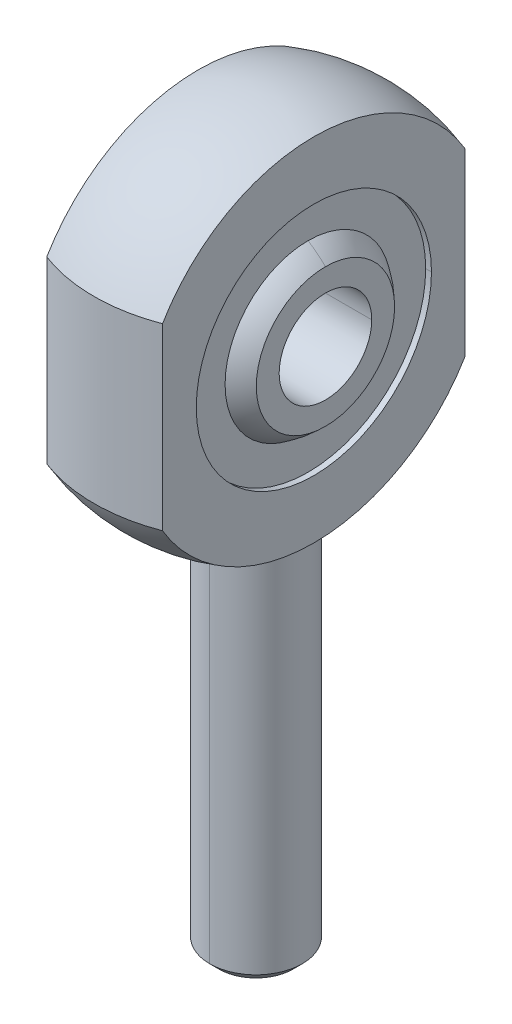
ISO-10303-21;
HEADER;
FILE_DESCRIPTION(('STEP AP214'),'2;1');
FILE_NAME('part.step','',(''),(''),'','','');
FILE_SCHEMA(('AUTOMOTIVE_DESIGN { 1 0 10303 214 1 1 1 1 }'));
ENDSEC;
DATA;
#1=APPLICATION_CONTEXT('core data for automotive mechanical design processes');
#2=APPLICATION_PROTOCOL_DEFINITION('international standard','automotive_design',2000,#1);
#3=PRODUCT_CONTEXT('',#1,'mechanical');
#4=PRODUCT('Part','Part','',(#3));
#5=PRODUCT_RELATED_PRODUCT_CATEGORY('part','',(#4));
#6=PRODUCT_DEFINITION_FORMATION('','',#4);
#7=PRODUCT_DEFINITION_CONTEXT('part definition',#1,'design');
#8=PRODUCT_DEFINITION('design','',#6,#7);
#9=PRODUCT_DEFINITION_SHAPE('','',#8);
#10=(LENGTH_UNIT() NAMED_UNIT(*) SI_UNIT(.MILLI.,.METRE.));
#11=(NAMED_UNIT(*) PLANE_ANGLE_UNIT() SI_UNIT($,.RADIAN.));
#12=(NAMED_UNIT(*) SI_UNIT($,.STERADIAN.) SOLID_ANGLE_UNIT());
#13=UNCERTAINTY_MEASURE_WITH_UNIT(LENGTH_MEASURE(1.E-05),#10,'distance_accuracy_value','');
#14=(GEOMETRIC_REPRESENTATION_CONTEXT(3) GLOBAL_UNCERTAINTY_ASSIGNED_CONTEXT((#13)) GLOBAL_UNIT_ASSIGNED_CONTEXT((#10,
#11,#12)) REPRESENTATION_CONTEXT('',''));
#15=CARTESIAN_POINT('',(0.,0.,0.));
#16=DIRECTION('',(0.,0.,1.));
#17=DIRECTION('',(1.,0.,0.));
#18=AXIS2_PLACEMENT_3D('',#15,#16,#17);
#19=CARTESIAN_POINT('',(4.5,0.,0.));
#20=DIRECTION('',(1.,0.,0.));
#21=DIRECTION('',(0.,1.,0.));
#22=AXIS2_PLACEMENT_3D('',#19,#20,#21);
#23=SPHERICAL_SURFACE('',#22,12.);
#24=CARTESIAN_POINT('',(4.5,-5.80947501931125,0.));
#25=DIRECTION('',(0.,1.,0.));
#26=DIRECTION('',(0.,0.,1.));
#27=AXIS2_PLACEMENT_3D('',#24,#25,#26);
#28=CIRCLE('',#27,10.5);
#29=CARTESIAN_POINT('',(8.25,-5.80947501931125,-9.80752262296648));
#30=VERTEX_POINT('',#29);
#31=CARTESIAN_POINT('',(0.75,-5.80947501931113,-9.80752262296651));
#32=VERTEX_POINT('',#31);
#33=EDGE_CURVE('E11',#30,#32,#28,.T.);
#34=ORIENTED_EDGE('',*,*,#33,.F.);
#35=CARTESIAN_POINT('',(8.25,0.,0.));
#36=DIRECTION('',(1.,0.,0.));
#37=DIRECTION('',(0.,0.,-1.));
#38=AXIS2_PLACEMENT_3D('',#35,#36,#37);
#39=CIRCLE('',#38,11.399013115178);
#40=CARTESIAN_POINT('',(8.25,-5.80947501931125,9.80752262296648));
#41=VERTEX_POINT('',#40);
#42=EDGE_CURVE('E24',#41,#30,#39,.T.);
#43=ORIENTED_EDGE('',*,*,#42,.F.);
#44=CARTESIAN_POINT('',(4.5,-5.80947501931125,0.));
#45=DIRECTION('',(0.,1.,0.));
#46=DIRECTION('',(0.,0.,1.));
#47=AXIS2_PLACEMENT_3D('',#44,#45,#46);
#48=CIRCLE('',#47,10.5);
#49=CARTESIAN_POINT('',(0.75,-5.80947501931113,9.80752262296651));
#50=VERTEX_POINT('',#49);
#51=EDGE_CURVE('E370',#50,#41,#48,.T.);
#52=ORIENTED_EDGE('',*,*,#51,.F.);
#53=CARTESIAN_POINT('',(0.75,0.,0.));
#54=DIRECTION('',(1.,0.,0.));
#55=DIRECTION('',(0.,0.,-1.));
#56=AXIS2_PLACEMENT_3D('',#53,#54,#55);
#57=CIRCLE('',#56,11.399013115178);
#58=EDGE_CURVE('E366',#50,#32,#57,.T.);
#59=ORIENTED_EDGE('',*,*,#58,.T.);
#60=EDGE_LOOP('',(#34,#43,#52,#59));
#61=FACE_BOUND('',#60,.T.);
#62=CARTESIAN_POINT('',(4.5,-11.6189500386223,0.));
#63=DIRECTION('',(0.,1.,0.));
#64=DIRECTION('',(0.,0.,1.));
#65=AXIS2_PLACEMENT_3D('',#62,#63,#64);
#66=CIRCLE('',#65,3.);
#67=CARTESIAN_POINT('',(4.5,-11.6189500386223,3.));
#68=VERTEX_POINT('',#67);
#69=CARTESIAN_POINT('',(4.5,-11.6189500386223,-3.));
#70=VERTEX_POINT('',#69);
#71=EDGE_CURVE('E362',#68,#70,#66,.T.);
#72=ORIENTED_EDGE('',*,*,#71,.T.);
#73=CARTESIAN_POINT('',(4.5,-11.6189500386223,0.));
#74=DIRECTION('',(0.,1.,0.));
#75=DIRECTION('',(0.,0.,1.));
#76=AXIS2_PLACEMENT_3D('',#73,#74,#75);
#77=CIRCLE('',#76,3.);
#78=EDGE_CURVE('E358',#70,#68,#77,.T.);
#79=ORIENTED_EDGE('',*,*,#78,.T.);
#80=EDGE_LOOP('',(#72,#79));
#81=FACE_BOUND('',#80,.T.);
#82=ADVANCED_FACE('F16',(#61,#81),#23,.T.);
#83=CARTESIAN_POINT('',(4.5,-29.255,0.));
#84=DIRECTION('',(0.,-1.,0.));
#85=DIRECTION('',(1.,0.,-1.61702901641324E-09));
#86=AXIS2_PLACEMENT_3D('',#83,#84,#85);
#87=CYLINDRICAL_SURFACE('',#86,3.);
#88=DIRECTION('',(0.,-1.,0.));
#89=VECTOR('',#88,1.);
#90=CARTESIAN_POINT('',(4.5,-11.6189500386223,3.));
#91=LINE('',#90,#89);
#92=CARTESIAN_POINT('',(4.5,-35.3865,3.));
#93=VERTEX_POINT('',#92);
#94=EDGE_CURVE('E353',#68,#93,#91,.T.);
#95=ORIENTED_EDGE('',*,*,#94,.F.);
#96=ORIENTED_EDGE('',*,*,#78,.F.);
#97=DIRECTION('',(0.,-1.,0.));
#98=VECTOR('',#97,1.);
#99=CARTESIAN_POINT('',(4.5,-11.6189500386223,-3.));
#100=LINE('',#99,#98);
#101=CARTESIAN_POINT('',(4.5,-35.3865,-3.));
#102=VERTEX_POINT('',#101);
#103=EDGE_CURVE('E349',#70,#102,#100,.T.);
#104=ORIENTED_EDGE('',*,*,#103,.T.);
#105=CARTESIAN_POINT('',(4.5,-35.3865,0.));
#106=DIRECTION('',(0.,-1.,0.));
#107=DIRECTION('',(0.,0.,-1.));
#108=AXIS2_PLACEMENT_3D('',#105,#106,#107);
#109=CIRCLE('',#108,3.);
#110=EDGE_CURVE('E344',#93,#102,#109,.T.);
#111=ORIENTED_EDGE('',*,*,#110,.F.);
#112=EDGE_LOOP('',(#95,#96,#104,#111));
#113=FACE_BOUND('',#112,.T.);
#114=ADVANCED_FACE('F408',(#113),#87,.T.);
#115=CARTESIAN_POINT('',(4.5,-35.3865,0.));
#116=DIRECTION('',(0.,1.,0.));
#117=DIRECTION('',(1.,0.,0.));
#118=AXIS2_PLACEMENT_3D('',#115,#116,#117);
#119=CONICAL_SURFACE('',#118,3.,0.785398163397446);
#120=DIRECTION('',(0.,0.70710678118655,-0.707106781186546));
#121=VECTOR('',#120,1.);
#122=CARTESIAN_POINT('',(4.5,-36.,-2.3865));
#123=LINE('',#122,#121);
#124=CARTESIAN_POINT('',(4.5,-36.,-2.3865));
#125=VERTEX_POINT('',#124);
#126=EDGE_CURVE('E339',#125,#102,#123,.T.);
#127=ORIENTED_EDGE('',*,*,#126,.F.);
#128=CARTESIAN_POINT('',(4.5,-36.,0.));
#129=DIRECTION('',(0.,-1.,0.));
#130=DIRECTION('',(0.,0.,-1.));
#131=AXIS2_PLACEMENT_3D('',#128,#129,#130);
#132=CIRCLE('',#131,2.3865);
#133=CARTESIAN_POINT('',(4.5,-36.,2.3865));
#134=VERTEX_POINT('',#133);
#135=EDGE_CURVE('E334',#134,#125,#132,.T.);
#136=ORIENTED_EDGE('',*,*,#135,.F.);
#137=DIRECTION('',(0.,0.70710678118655,0.707106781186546));
#138=VECTOR('',#137,1.);
#139=CARTESIAN_POINT('',(4.5,-36.,2.3865));
#140=LINE('',#139,#138);
#141=EDGE_CURVE('E329',#134,#93,#140,.T.);
#142=ORIENTED_EDGE('',*,*,#141,.T.);
#143=ORIENTED_EDGE('',*,*,#110,.T.);
#144=EDGE_LOOP('',(#127,#136,#142,#143));
#145=FACE_BOUND('',#144,.T.);
#146=ADVANCED_FACE('F412',(#145),#119,.T.);
#147=CARTESIAN_POINT('',(4.5,-35.3865,0.));
#148=DIRECTION('',(0.,1.,0.));
#149=DIRECTION('',(-1.,0.,0.));
#150=AXIS2_PLACEMENT_3D('',#147,#148,#149);
#151=CONICAL_SURFACE('',#150,3.,0.785398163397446);
#152=ORIENTED_EDGE('',*,*,#126,.T.);
#153=CARTESIAN_POINT('',(4.5,-35.3865,0.));
#154=DIRECTION('',(0.,-1.,0.));
#155=DIRECTION('',(0.,0.,-1.));
#156=AXIS2_PLACEMENT_3D('',#153,#154,#155);
#157=CIRCLE('',#156,3.);
#158=EDGE_CURVE('E324',#102,#93,#157,.T.);
#159=ORIENTED_EDGE('',*,*,#158,.T.);
#160=ORIENTED_EDGE('',*,*,#141,.F.);
#161=CARTESIAN_POINT('',(4.5,-36.,0.));
#162=DIRECTION('',(0.,-1.,0.));
#163=DIRECTION('',(0.,0.,-1.));
#164=AXIS2_PLACEMENT_3D('',#161,#162,#163);
#165=CIRCLE('',#164,2.3865);
#166=EDGE_CURVE('E319',#125,#134,#165,.T.);
#167=ORIENTED_EDGE('',*,*,#166,.F.);
#168=EDGE_LOOP('',(#152,#159,#160,#167));
#169=FACE_BOUND('',#168,.T.);
#170=ADVANCED_FACE('F417',(#169),#151,.T.);
#171=CARTESIAN_POINT('',(6.8865,-36.,0.));
#172=DIRECTION('',(0.,1.,0.));
#173=DIRECTION('',(0.,0.,1.));
#174=AXIS2_PLACEMENT_3D('',#171,#172,#173);
#175=PLANE('',#174);
#176=ORIENTED_EDGE('',*,*,#166,.T.);
#177=ORIENTED_EDGE('',*,*,#135,.T.);
#178=EDGE_LOOP('',(#176,#177));
#179=FACE_BOUND('',#178,.T.);
#180=ADVANCED_FACE('F424',(#179),#175,.F.);
#181=CARTESIAN_POINT('',(4.5,-29.255,0.));
#182=DIRECTION('',(0.,-1.,0.));
#183=DIRECTION('',(-1.,0.,0.));
#184=AXIS2_PLACEMENT_3D('',#181,#182,#183);
#185=CYLINDRICAL_SURFACE('',#184,3.);
#186=ORIENTED_EDGE('',*,*,#94,.T.);
#187=ORIENTED_EDGE('',*,*,#158,.F.);
#188=ORIENTED_EDGE('',*,*,#103,.F.);
#189=ORIENTED_EDGE('',*,*,#71,.F.);
#190=EDGE_LOOP('',(#186,#187,#188,#189));
#191=FACE_BOUND('',#190,.T.);
#192=ADVANCED_FACE('F404',(#191),#185,.T.);
#193=CARTESIAN_POINT('',(0.75,11.399013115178,0.));
#194=DIRECTION('',(-1.,0.,0.));
#195=DIRECTION('',(0.,0.,1.));
#196=AXIS2_PLACEMENT_3D('',#193,#194,#195);
#197=PLANE('',#196);
#198=CARTESIAN_POINT('',(0.75,0.,0.));
#199=DIRECTION('',(1.,0.,0.));
#200=DIRECTION('',(0.,0.,-1.));
#201=AXIS2_PLACEMENT_3D('',#198,#199,#200);
#202=CIRCLE('',#201,7.62);
#203=CARTESIAN_POINT('',(0.75,0.,-7.62));
#204=VERTEX_POINT('',#203);
#205=CARTESIAN_POINT('',(0.75,0.,7.62));
#206=VERTEX_POINT('',#205);
#207=EDGE_CURVE('E144',#204,#206,#202,.T.);
#208=ORIENTED_EDGE('',*,*,#207,.T.);
#209=CARTESIAN_POINT('',(0.75,0.,0.));
#210=DIRECTION('',(1.,0.,0.));
#211=DIRECTION('',(0.,0.,-1.));
#212=AXIS2_PLACEMENT_3D('',#209,#210,#211);
#213=CIRCLE('',#212,7.62);
#214=EDGE_CURVE('E312',#206,#204,#213,.T.);
#215=ORIENTED_EDGE('',*,*,#214,.T.);
#216=EDGE_LOOP('',(#208,#215));
#217=FACE_BOUND('',#216,.T.);
#218=DIRECTION('',(0.,1.,0.));
#219=VECTOR('',#218,1.);
#220=CARTESIAN_POINT('',(0.75,21.,-9.80752262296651));
#221=LINE('',#220,#219);
#222=CARTESIAN_POINT('',(0.75,5.80947501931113,-9.80752262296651));
#223=VERTEX_POINT('',#222);
#224=EDGE_CURVE('E307',#32,#223,#221,.T.);
#225=ORIENTED_EDGE('',*,*,#224,.F.);
#226=ORIENTED_EDGE('',*,*,#58,.F.);
#227=DIRECTION('',(0.,-1.,0.));
#228=VECTOR('',#227,1.);
#229=CARTESIAN_POINT('',(0.75,21.,9.80752262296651));
#230=LINE('',#229,#228);
#231=CARTESIAN_POINT('',(0.75,5.80947501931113,9.80752262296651));
#232=VERTEX_POINT('',#231);
#233=EDGE_CURVE('E302',#232,#50,#230,.T.);
#234=ORIENTED_EDGE('',*,*,#233,.F.);
#235=CARTESIAN_POINT('',(0.75,0.,0.));
#236=DIRECTION('',(1.,0.,0.));
#237=DIRECTION('',(0.,0.,-1.));
#238=AXIS2_PLACEMENT_3D('',#235,#236,#237);
#239=CIRCLE('',#238,11.399013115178);
#240=EDGE_CURVE('E297',#223,#232,#239,.T.);
#241=ORIENTED_EDGE('',*,*,#240,.F.);
#242=EDGE_LOOP('',(#225,#226,#234,#241));
#243=FACE_BOUND('',#242,.T.);
#244=ADVANCED_FACE('F389',(#217,#243),#197,.T.);
#245=CARTESIAN_POINT('',(4.5,0.,0.));
#246=DIRECTION('',(1.,0.,0.));
#247=DIRECTION('',(0.,-1.,0.));
#248=AXIS2_PLACEMENT_3D('',#245,#246,#247);
#249=SPHERICAL_SURFACE('',#248,12.);
#250=CARTESIAN_POINT('',(4.5,5.80947501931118,0.));
#251=DIRECTION('',(0.,-1.,0.));
#252=DIRECTION('',(0.,0.,-1.));
#253=AXIS2_PLACEMENT_3D('',#250,#251,#252);
#254=CIRCLE('',#253,10.5);
#255=CARTESIAN_POINT('',(8.25,5.80947501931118,-9.8075226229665));
#256=VERTEX_POINT('',#255);
#257=EDGE_CURVE('E292',#223,#256,#254,.T.);
#258=ORIENTED_EDGE('',*,*,#257,.F.);
#259=ORIENTED_EDGE('',*,*,#240,.T.);
#260=CARTESIAN_POINT('',(4.5,5.80947501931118,0.));
#261=DIRECTION('',(0.,-1.,0.));
#262=DIRECTION('',(0.,0.,-1.));
#263=AXIS2_PLACEMENT_3D('',#260,#261,#262);
#264=CIRCLE('',#263,10.5);
#265=CARTESIAN_POINT('',(8.25,5.80947501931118,9.8075226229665));
#266=VERTEX_POINT('',#265);
#267=EDGE_CURVE('E287',#266,#232,#264,.T.);
#268=ORIENTED_EDGE('',*,*,#267,.F.);
#269=CARTESIAN_POINT('',(8.25,0.,0.));
#270=DIRECTION('',(1.,0.,0.));
#271=DIRECTION('',(0.,0.,-1.));
#272=AXIS2_PLACEMENT_3D('',#269,#270,#271);
#273=CIRCLE('',#272,11.399013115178);
#274=EDGE_CURVE('E282',#256,#266,#273,.T.);
#275=ORIENTED_EDGE('',*,*,#274,.F.);
#276=EDGE_LOOP('',(#258,#259,#268,#275));
#277=FACE_BOUND('',#276,.T.);
#278=ADVANCED_FACE('F394',(#277),#249,.T.);
#279=CARTESIAN_POINT('',(8.25,7.62,0.));
#280=DIRECTION('',(1.,0.,0.));
#281=DIRECTION('',(0.,0.,-1.));
#282=AXIS2_PLACEMENT_3D('',#279,#280,#281);
#283=PLANE('',#282);
#284=DIRECTION('',(0.,-1.,0.));
#285=VECTOR('',#284,1.);
#286=CARTESIAN_POINT('',(8.25,21.,-9.80752262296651));
#287=LINE('',#286,#285);
#288=EDGE_CURVE('E278',#256,#30,#287,.T.);
#289=ORIENTED_EDGE('',*,*,#288,.F.);
#290=ORIENTED_EDGE('',*,*,#274,.T.);
#291=DIRECTION('',(0.,1.,0.));
#292=VECTOR('',#291,1.);
#293=CARTESIAN_POINT('',(8.25,21.,9.80752262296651));
#294=LINE('',#293,#292);
#295=EDGE_CURVE('E273',#41,#266,#294,.T.);
#296=ORIENTED_EDGE('',*,*,#295,.F.);
#297=ORIENTED_EDGE('',*,*,#42,.T.);
#298=EDGE_LOOP('',(#289,#290,#296,#297));
#299=FACE_BOUND('',#298,.T.);
#300=CARTESIAN_POINT('',(8.25,0.,0.));
#301=DIRECTION('',(1.,0.,0.));
#302=DIRECTION('',(0.,0.,-1.));
#303=AXIS2_PLACEMENT_3D('',#300,#301,#302);
#304=CIRCLE('',#303,7.62);
#305=CARTESIAN_POINT('',(8.25,0.,7.62));
#306=VERTEX_POINT('',#305);
#307=CARTESIAN_POINT('',(8.25,0.,-7.62));
#308=VERTEX_POINT('',#307);
#309=EDGE_CURVE('E268',#306,#308,#304,.T.);
#310=ORIENTED_EDGE('',*,*,#309,.F.);
#311=CARTESIAN_POINT('',(8.25,0.,0.));
#312=DIRECTION('',(1.,0.,0.));
#313=DIRECTION('',(0.,0.,-1.));
#314=AXIS2_PLACEMENT_3D('',#311,#312,#313);
#315=CIRCLE('',#314,7.62);
#316=EDGE_CURVE('E263',#308,#306,#315,.T.);
#317=ORIENTED_EDGE('',*,*,#316,.F.);
#318=EDGE_LOOP('',(#310,#317));
#319=FACE_BOUND('',#318,.T.);
#320=ADVANCED_FACE('F381',(#299,#319),#283,.T.);
#321=CARTESIAN_POINT('',(100.,0.,0.));
#322=DIRECTION('',(1.,0.,0.));
#323=DIRECTION('',(0.,-1.,0.));
#324=AXIS2_PLACEMENT_3D('',#321,#322,#323);
#325=CYLINDRICAL_SURFACE('',#324,7.62);
#326=DIRECTION('',(1.,0.,0.));
#327=VECTOR('',#326,1.);
#328=CARTESIAN_POINT('',(7.875,0.,7.62));
#329=LINE('',#328,#327);
#330=CARTESIAN_POINT('',(7.875,0.,7.62));
#331=VERTEX_POINT('',#330);
#332=EDGE_CURVE('E258',#331,#306,#329,.T.);
#333=ORIENTED_EDGE('',*,*,#332,.F.);
#334=CARTESIAN_POINT('',(7.875,0.,0.));
#335=DIRECTION('',(1.,0.,0.));
#336=DIRECTION('',(0.,0.,-1.));
#337=AXIS2_PLACEMENT_3D('',#334,#335,#336);
#338=CIRCLE('',#337,7.62);
#339=CARTESIAN_POINT('',(7.875,0.,-7.62));
#340=VERTEX_POINT('',#339);
#341=EDGE_CURVE('E253',#340,#331,#338,.T.);
#342=ORIENTED_EDGE('',*,*,#341,.F.);
#343=DIRECTION('',(1.,0.,0.));
#344=VECTOR('',#343,1.);
#345=CARTESIAN_POINT('',(7.875,0.,-7.62));
#346=LINE('',#345,#344);
#347=EDGE_CURVE('E248',#340,#308,#346,.T.);
#348=ORIENTED_EDGE('',*,*,#347,.T.);
#349=ORIENTED_EDGE('',*,*,#316,.T.);
#350=EDGE_LOOP('',(#333,#342,#348,#349));
#351=FACE_BOUND('',#350,.T.);
#352=ADVANCED_FACE('F402',(#351),#325,.F.);
#353=CARTESIAN_POINT('',(100.,0.,0.));
#354=DIRECTION('',(1.,0.,0.));
#355=DIRECTION('',(0.,1.,0.));
#356=AXIS2_PLACEMENT_3D('',#353,#354,#355);
#357=CYLINDRICAL_SURFACE('',#356,7.62);
#358=ORIENTED_EDGE('',*,*,#332,.T.);
#359=ORIENTED_EDGE('',*,*,#309,.T.);
#360=ORIENTED_EDGE('',*,*,#347,.F.);
#361=CARTESIAN_POINT('',(7.875,0.,0.));
#362=DIRECTION('',(1.,0.,0.));
#363=DIRECTION('',(0.,0.,-1.));
#364=AXIS2_PLACEMENT_3D('',#361,#362,#363);
#365=CIRCLE('',#364,7.62);
#366=EDGE_CURVE('E243',#331,#340,#365,.T.);
#367=ORIENTED_EDGE('',*,*,#366,.F.);
#368=EDGE_LOOP('',(#358,#359,#360,#367));
#369=FACE_BOUND('',#368,.T.);
#370=ADVANCED_FACE('F469',(#369),#357,.F.);
#371=CARTESIAN_POINT('',(7.875,5.3788358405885,0.));
#372=DIRECTION('',(1.,0.,0.));
#373=DIRECTION('',(0.,0.,-1.));
#374=AXIS2_PLACEMENT_3D('',#371,#372,#373);
#375=PLANE('',#374);
#376=ORIENTED_EDGE('',*,*,#341,.T.);
#377=ORIENTED_EDGE('',*,*,#366,.T.);
#378=EDGE_LOOP('',(#376,#377));
#379=FACE_BOUND('',#378,.T.);
#380=CARTESIAN_POINT('',(7.875,0.,0.));
#381=DIRECTION('',(1.,0.,0.));
#382=DIRECTION('',(0.,-1.,0.));
#383=AXIS2_PLACEMENT_3D('',#380,#381,#382);
#384=CIRCLE('',#383,5.3788358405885);
#385=CARTESIAN_POINT('',(7.87500000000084,-5.3788358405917,0.));
#386=VERTEX_POINT('',#385);
#387=CARTESIAN_POINT('',(7.87500000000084,5.37883584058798,0.));
#388=VERTEX_POINT('',#387);
#389=EDGE_CURVE('E238',#386,#388,#384,.T.);
#390=ORIENTED_EDGE('',*,*,#389,.F.);
#391=CARTESIAN_POINT('',(7.875,0.,0.));
#392=DIRECTION('',(1.,0.,0.));
#393=DIRECTION('',(0.,0.,-1.));
#394=AXIS2_PLACEMENT_3D('',#391,#392,#393);
#395=CIRCLE('',#394,5.3788358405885);
#396=EDGE_CURVE('E233',#388,#386,#395,.T.);
#397=ORIENTED_EDGE('',*,*,#396,.F.);
#398=EDGE_LOOP('',(#390,#397));
#399=FACE_BOUND('',#398,.T.);
#400=ADVANCED_FACE('F479',(#379,#399),#375,.T.);
#401=CARTESIAN_POINT('',(4.49999999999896,-1.86135828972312E-12,0.));
#402=DIRECTION('',(1.,0.,0.));
#403=DIRECTION('',(0.,0.,-1.));
#404=AXIS2_PLACEMENT_3D('',#401,#402,#403);
#405=SPHERICAL_SURFACE('',#404,6.35000000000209);
#406=CARTESIAN_POINT('',(4.49999999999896,-1.86135828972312E-12,0.));
#407=DIRECTION('',(0.,0.,-1.));
#408=DIRECTION('',(0.708661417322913,-0.705548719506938,0.));
#409=AXIS2_PLACEMENT_3D('',#406,#407,#408);
#410=CIRCLE('',#409,6.35000000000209);
#411=CARTESIAN_POINT('',(9.00000000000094,-4.48023436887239,0.));
#412=VERTEX_POINT('',#411);
#413=EDGE_CURVE('E228',#412,#386,#410,.T.);
#414=ORIENTED_EDGE('',*,*,#413,.F.);
#415=CARTESIAN_POINT('',(9.,0.,0.));
#416=DIRECTION('',(1.,0.,0.));
#417=DIRECTION('',(0.,0.,-1.));
#418=AXIS2_PLACEMENT_3D('',#415,#416,#417);
#419=CIRCLE('',#418,4.4802343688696);
#420=CARTESIAN_POINT('',(9.00000000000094,4.48023436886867,0.));
#421=VERTEX_POINT('',#420);
#422=EDGE_CURVE('E223',#421,#412,#419,.T.);
#423=ORIENTED_EDGE('',*,*,#422,.F.);
#424=CARTESIAN_POINT('',(4.49999999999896,-1.86135828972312E-12,0.));
#425=DIRECTION('',(0.,0.,1.));
#426=DIRECTION('',(0.708661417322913,0.705548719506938,0.));
#427=AXIS2_PLACEMENT_3D('',#424,#425,#426);
#428=CIRCLE('',#427,6.35000000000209);
#429=EDGE_CURVE('E218',#421,#388,#428,.T.);
#430=ORIENTED_EDGE('',*,*,#429,.T.);
#431=ORIENTED_EDGE('',*,*,#396,.T.);
#432=EDGE_LOOP('',(#414,#423,#430,#431));
#433=FACE_BOUND('',#432,.T.);
#434=ADVANCED_FACE('F489',(#433),#405,.T.);
#435=CARTESIAN_POINT('',(4.49999999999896,-1.86135828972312E-12,0.));
#436=DIRECTION('',(1.,0.,0.));
#437=DIRECTION('',(0.,0.,1.));
#438=AXIS2_PLACEMENT_3D('',#435,#436,#437);
#439=SPHERICAL_SURFACE('',#438,6.35000000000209);
#440=ORIENTED_EDGE('',*,*,#413,.T.);
#441=ORIENTED_EDGE('',*,*,#389,.T.);
#442=ORIENTED_EDGE('',*,*,#429,.F.);
#443=CARTESIAN_POINT('',(9.,0.,0.));
#444=DIRECTION('',(1.,0.,0.));
#445=DIRECTION('',(0.,-1.,0.));
#446=AXIS2_PLACEMENT_3D('',#443,#444,#445);
#447=CIRCLE('',#446,4.4802343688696);
#448=EDGE_CURVE('E213',#412,#421,#447,.T.);
#449=ORIENTED_EDGE('',*,*,#448,.F.);
#450=EDGE_LOOP('',(#440,#441,#442,#449));
#451=FACE_BOUND('',#450,.T.);
#452=ADVANCED_FACE('F499',(#451),#439,.T.);
#453=CARTESIAN_POINT('',(9.,3.,0.));
#454=DIRECTION('',(1.,0.,0.));
#455=DIRECTION('',(0.,0.,-1.));
#456=AXIS2_PLACEMENT_3D('',#453,#454,#455);
#457=PLANE('',#456);
#458=ORIENTED_EDGE('',*,*,#422,.T.);
#459=ORIENTED_EDGE('',*,*,#448,.T.);
#460=EDGE_LOOP('',(#458,#459));
#461=FACE_BOUND('',#460,.T.);
#462=CARTESIAN_POINT('',(9.,0.,0.));
#463=DIRECTION('',(1.,0.,0.));
#464=DIRECTION('',(0.,0.,-1.));
#465=AXIS2_PLACEMENT_3D('',#462,#463,#464);
#466=CIRCLE('',#465,3.);
#467=CARTESIAN_POINT('',(9.,0.,3.));
#468=VERTEX_POINT('',#467);
#469=CARTESIAN_POINT('',(9.,0.,-3.));
#470=VERTEX_POINT('',#469);
#471=EDGE_CURVE('E208',#468,#470,#466,.T.);
#472=ORIENTED_EDGE('',*,*,#471,.F.);
#473=CARTESIAN_POINT('',(9.,0.,0.));
#474=DIRECTION('',(1.,0.,0.));
#475=DIRECTION('',(0.,0.,-1.));
#476=AXIS2_PLACEMENT_3D('',#473,#474,#475);
#477=CIRCLE('',#476,3.);
#478=EDGE_CURVE('E203',#470,#468,#477,.T.);
#479=ORIENTED_EDGE('',*,*,#478,.F.);
#480=EDGE_LOOP('',(#472,#479));
#481=FACE_BOUND('',#480,.T.);
#482=ADVANCED_FACE('F509',(#461,#481),#457,.T.);
#483=CARTESIAN_POINT('',(100.,0.,0.));
#484=DIRECTION('',(1.,0.,0.));
#485=DIRECTION('',(0.,-1.,0.));
#486=AXIS2_PLACEMENT_3D('',#483,#484,#485);
#487=CYLINDRICAL_SURFACE('',#486,3.);
#488=DIRECTION('',(1.,0.,0.));
#489=VECTOR('',#488,1.);
#490=CARTESIAN_POINT('',(0.,0.,3.));
#491=LINE('',#490,#489);
#492=CARTESIAN_POINT('',(0.,0.,3.));
#493=VERTEX_POINT('',#492);
#494=EDGE_CURVE('E198',#493,#468,#491,.T.);
#495=ORIENTED_EDGE('',*,*,#494,.F.);
#496=CARTESIAN_POINT('',(0.,0.,0.));
#497=DIRECTION('',(1.,0.,0.));
#498=DIRECTION('',(0.,0.,-1.));
#499=AXIS2_PLACEMENT_3D('',#496,#497,#498);
#500=CIRCLE('',#499,3.);
#501=CARTESIAN_POINT('',(0.,0.,-3.));
#502=VERTEX_POINT('',#501);
#503=EDGE_CURVE('E193',#502,#493,#500,.T.);
#504=ORIENTED_EDGE('',*,*,#503,.F.);
#505=DIRECTION('',(1.,0.,0.));
#506=VECTOR('',#505,1.);
#507=CARTESIAN_POINT('',(0.,0.,-3.));
#508=LINE('',#507,#506);
#509=EDGE_CURVE('E188',#502,#470,#508,.T.);
#510=ORIENTED_EDGE('',*,*,#509,.T.);
#511=ORIENTED_EDGE('',*,*,#478,.T.);
#512=EDGE_LOOP('',(#495,#504,#510,#511));
#513=FACE_BOUND('',#512,.T.);
#514=ADVANCED_FACE('F519',(#513),#487,.F.);
#515=CARTESIAN_POINT('',(100.,0.,0.));
#516=DIRECTION('',(1.,0.,0.));
#517=DIRECTION('',(0.,1.,0.));
#518=AXIS2_PLACEMENT_3D('',#515,#516,#517);
#519=CYLINDRICAL_SURFACE('',#518,3.);
#520=ORIENTED_EDGE('',*,*,#494,.T.);
#521=ORIENTED_EDGE('',*,*,#471,.T.);
#522=ORIENTED_EDGE('',*,*,#509,.F.);
#523=CARTESIAN_POINT('',(0.,0.,0.));
#524=DIRECTION('',(1.,0.,0.));
#525=DIRECTION('',(0.,0.,-1.));
#526=AXIS2_PLACEMENT_3D('',#523,#524,#525);
#527=CIRCLE('',#526,3.);
#528=EDGE_CURVE('E183',#493,#502,#527,.T.);
#529=ORIENTED_EDGE('',*,*,#528,.F.);
#530=EDGE_LOOP('',(#520,#521,#522,#529));
#531=FACE_BOUND('',#530,.T.);
#532=ADVANCED_FACE('F529',(#531),#519,.F.);
#533=CARTESIAN_POINT('',(0.,4.4802343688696,0.));
#534=DIRECTION('',(-1.,0.,0.));
#535=DIRECTION('',(0.,0.,1.));
#536=AXIS2_PLACEMENT_3D('',#533,#534,#535);
#537=PLANE('',#536);
#538=ORIENTED_EDGE('',*,*,#503,.T.);
#539=ORIENTED_EDGE('',*,*,#528,.T.);
#540=EDGE_LOOP('',(#538,#539));
#541=FACE_BOUND('',#540,.T.);
#542=CARTESIAN_POINT('',(0.,0.,0.));
#543=DIRECTION('',(1.,0.,0.));
#544=DIRECTION('',(0.,0.,-1.));
#545=AXIS2_PLACEMENT_3D('',#542,#543,#544);
#546=CIRCLE('',#545,4.4802343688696);
#547=CARTESIAN_POINT('',(-2.61302091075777E-12,4.48023436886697,0.));
#548=VERTEX_POINT('',#547);
#549=CARTESIAN_POINT('',(-2.61302091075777E-12,-4.48023436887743,0.));
#550=VERTEX_POINT('',#549);
#551=EDGE_CURVE('E178',#548,#550,#546,.T.);
#552=ORIENTED_EDGE('',*,*,#551,.F.);
#553=CARTESIAN_POINT('',(0.,0.,0.));
#554=DIRECTION('',(1.,0.,0.));
#555=DIRECTION('',(0.,-1.,0.));
#556=AXIS2_PLACEMENT_3D('',#553,#554,#555);
#557=CIRCLE('',#556,4.4802343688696);
#558=EDGE_CURVE('E173',#550,#548,#557,.T.);
#559=ORIENTED_EDGE('',*,*,#558,.F.);
#560=EDGE_LOOP('',(#552,#559));
#561=FACE_BOUND('',#560,.T.);
#562=ADVANCED_FACE('F539',(#541,#561),#537,.T.);
#563=CARTESIAN_POINT('',(4.50000000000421,-5.22758919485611E-12,0.));
#564=DIRECTION('',(1.,0.,0.));
#565=DIRECTION('',(0.,0.,1.));
#566=AXIS2_PLACEMENT_3D('',#563,#564,#565);
#567=SPHERICAL_SURFACE('',#566,6.3500000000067);
#568=CARTESIAN_POINT('',(4.50000000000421,-5.22758919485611E-12,0.));
#569=DIRECTION('',(0.,0.,-1.));
#570=DIRECTION('',(-0.531496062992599,-0.847060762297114,0.));
#571=AXIS2_PLACEMENT_3D('',#568,#569,#570);
#572=CIRCLE('',#571,6.3500000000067);
#573=CARTESIAN_POINT('',(1.12499999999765,-5.37883584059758,0.));
#574=VERTEX_POINT('',#573);
#575=EDGE_CURVE('E168',#574,#550,#572,.T.);
#576=ORIENTED_EDGE('',*,*,#575,.T.);
#577=ORIENTED_EDGE('',*,*,#558,.T.);
#578=CARTESIAN_POINT('',(4.50000000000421,-5.22758919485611E-12,0.));
#579=DIRECTION('',(0.,0.,1.));
#580=DIRECTION('',(-0.531496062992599,0.847060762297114,0.));
#581=AXIS2_PLACEMENT_3D('',#578,#579,#580);
#582=CIRCLE('',#581,6.3500000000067);
#583=CARTESIAN_POINT('',(1.12499999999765,5.37883584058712,0.));
#584=VERTEX_POINT('',#583);
#585=EDGE_CURVE('E163',#584,#548,#582,.T.);
#586=ORIENTED_EDGE('',*,*,#585,.F.);
#587=CARTESIAN_POINT('',(1.125,0.,0.));
#588=DIRECTION('',(1.,0.,0.));
#589=DIRECTION('',(0.,-1.,0.));
#590=AXIS2_PLACEMENT_3D('',#587,#588,#589);
#591=CIRCLE('',#590,5.3788358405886);
#592=EDGE_CURVE('E152',#574,#584,#591,.T.);
#593=ORIENTED_EDGE('',*,*,#592,.F.);
#594=EDGE_LOOP('',(#576,#577,#586,#593));
#595=FACE_BOUND('',#594,.T.);
#596=ADVANCED_FACE('F549',(#595),#567,.T.);
#597=CARTESIAN_POINT('',(1.125,7.62,0.));
#598=DIRECTION('',(-1.,0.,0.));
#599=DIRECTION('',(0.,0.,1.));
#600=AXIS2_PLACEMENT_3D('',#597,#598,#599);
#601=PLANE('',#600);
#602=CARTESIAN_POINT('',(1.125,0.,0.));
#603=DIRECTION('',(1.,0.,0.));
#604=DIRECTION('',(0.,0.,-1.));
#605=AXIS2_PLACEMENT_3D('',#602,#603,#604);
#606=CIRCLE('',#605,5.3788358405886);
#607=EDGE_CURVE('E149',#584,#574,#606,.T.);
#608=ORIENTED_EDGE('',*,*,#607,.T.);
#609=ORIENTED_EDGE('',*,*,#592,.T.);
#610=EDGE_LOOP('',(#608,#609));
#611=FACE_BOUND('',#610,.T.);
#612=CARTESIAN_POINT('',(1.125,0.,0.));
#613=DIRECTION('',(1.,0.,0.));
#614=DIRECTION('',(0.,0.,-1.));
#615=AXIS2_PLACEMENT_3D('',#612,#613,#614);
#616=CIRCLE('',#615,7.62);
#617=CARTESIAN_POINT('',(1.125,0.,7.62));
#618=VERTEX_POINT('',#617);
#619=CARTESIAN_POINT('',(1.125,0.,-7.62));
#620=VERTEX_POINT('',#619);
#621=EDGE_CURVE('E134',#618,#620,#616,.T.);
#622=ORIENTED_EDGE('',*,*,#621,.F.);
#623=CARTESIAN_POINT('',(1.125,0.,0.));
#624=DIRECTION('',(1.,0.,0.));
#625=DIRECTION('',(0.,0.,-1.));
#626=AXIS2_PLACEMENT_3D('',#623,#624,#625);
#627=CIRCLE('',#626,7.62);
#628=EDGE_CURVE('E130',#620,#618,#627,.T.);
#629=ORIENTED_EDGE('',*,*,#628,.F.);
#630=EDGE_LOOP('',(#622,#629));
#631=FACE_BOUND('',#630,.T.);
#632=ADVANCED_FACE('F132',(#611,#631),#601,.T.);
#633=CARTESIAN_POINT('',(100.,0.,0.));
#634=DIRECTION('',(1.,0.,0.));
#635=DIRECTION('',(0.,-1.,0.));
#636=AXIS2_PLACEMENT_3D('',#633,#634,#635);
#637=CYLINDRICAL_SURFACE('',#636,7.62);
#638=DIRECTION('',(1.,0.,0.));
#639=VECTOR('',#638,1.);
#640=CARTESIAN_POINT('',(0.75,0.,7.62));
#641=LINE('',#640,#639);
#642=EDGE_CURVE('E138',#206,#618,#641,.T.);
#643=ORIENTED_EDGE('',*,*,#642,.F.);
#644=ORIENTED_EDGE('',*,*,#207,.F.);
#645=DIRECTION('',(1.,0.,0.));
#646=VECTOR('',#645,1.);
#647=CARTESIAN_POINT('',(0.75,0.,-7.62));
#648=LINE('',#647,#646);
#649=EDGE_CURVE('E142',#204,#620,#648,.T.);
#650=ORIENTED_EDGE('',*,*,#649,.T.);
#651=ORIENTED_EDGE('',*,*,#628,.T.);
#652=EDGE_LOOP('',(#643,#644,#650,#651));
#653=FACE_BOUND('',#652,.T.);
#654=ADVANCED_FACE('F143',(#653),#637,.F.);
#655=CARTESIAN_POINT('',(100.,0.,0.));
#656=DIRECTION('',(1.,0.,0.));
#657=DIRECTION('',(0.,1.,0.));
#658=AXIS2_PLACEMENT_3D('',#655,#656,#657);
#659=CYLINDRICAL_SURFACE('',#658,7.62);
#660=ORIENTED_EDGE('',*,*,#642,.T.);
#661=ORIENTED_EDGE('',*,*,#621,.T.);
#662=ORIENTED_EDGE('',*,*,#649,.F.);
#663=ORIENTED_EDGE('',*,*,#214,.F.);
#664=EDGE_LOOP('',(#660,#661,#662,#663));
#665=FACE_BOUND('',#664,.T.);
#666=ADVANCED_FACE('F148',(#665),#659,.F.);
#667=CARTESIAN_POINT('',(4.50000000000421,-5.22758919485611E-12,0.));
#668=DIRECTION('',(1.,0.,0.));
#669=DIRECTION('',(0.,0.,-1.));
#670=AXIS2_PLACEMENT_3D('',#667,#668,#669);
#671=SPHERICAL_SURFACE('',#670,6.3500000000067);
#672=ORIENTED_EDGE('',*,*,#575,.F.);
#673=ORIENTED_EDGE('',*,*,#607,.F.);
#674=ORIENTED_EDGE('',*,*,#585,.T.);
#675=ORIENTED_EDGE('',*,*,#551,.T.);
#676=EDGE_LOOP('',(#672,#673,#674,#675));
#677=FACE_BOUND('',#676,.T.);
#678=ADVANCED_FACE('F585',(#677),#671,.T.);
#679=CARTESIAN_POINT('',(4.5,21.,0.));
#680=DIRECTION('',(0.,-1.,0.));
#681=DIRECTION('',(0.,0.,-1.));
#682=AXIS2_PLACEMENT_3D('',#679,#680,#681);
#683=CYLINDRICAL_SURFACE('',#682,10.5);
#684=ORIENTED_EDGE('',*,*,#295,.T.);
#685=ORIENTED_EDGE('',*,*,#267,.T.);
#686=ORIENTED_EDGE('',*,*,#233,.T.);
#687=ORIENTED_EDGE('',*,*,#51,.T.);
#688=EDGE_LOOP('',(#684,#685,#686,#687));
#689=FACE_BOUND('',#688,.T.);
#690=ADVANCED_FACE('F384',(#689),#683,.T.);
#691=CARTESIAN_POINT('',(4.5,21.,0.));
#692=DIRECTION('',(0.,-1.,0.));
#693=DIRECTION('',(0.,0.,1.));
#694=AXIS2_PLACEMENT_3D('',#691,#692,#693);
#695=CYLINDRICAL_SURFACE('',#694,10.5);
#696=ORIENTED_EDGE('',*,*,#288,.T.);
#697=ORIENTED_EDGE('',*,*,#33,.T.);
#698=ORIENTED_EDGE('',*,*,#224,.T.);
#699=ORIENTED_EDGE('',*,*,#257,.T.);
#700=EDGE_LOOP('',(#696,#697,#698,#699));
#701=FACE_BOUND('',#700,.T.);
#702=ADVANCED_FACE('F392',(#701),#695,.T.);
#703=CLOSED_SHELL('',(#82,#114,#146,#170,#180,#192,#244,#278,#320,#352,#370,#400,#434,#452,#482,
#514,#532,#562,#596,#632,#654,#666,#678,#690,#702));
#704=MANIFOLD_SOLID_BREP('B1',#703);
#705=ADVANCED_BREP_SHAPE_REPRESENTATION('',(#18,#704),#14);
#706=SHAPE_DEFINITION_REPRESENTATION(#9,#705);
ENDSEC;
END-ISO-10303-21;
